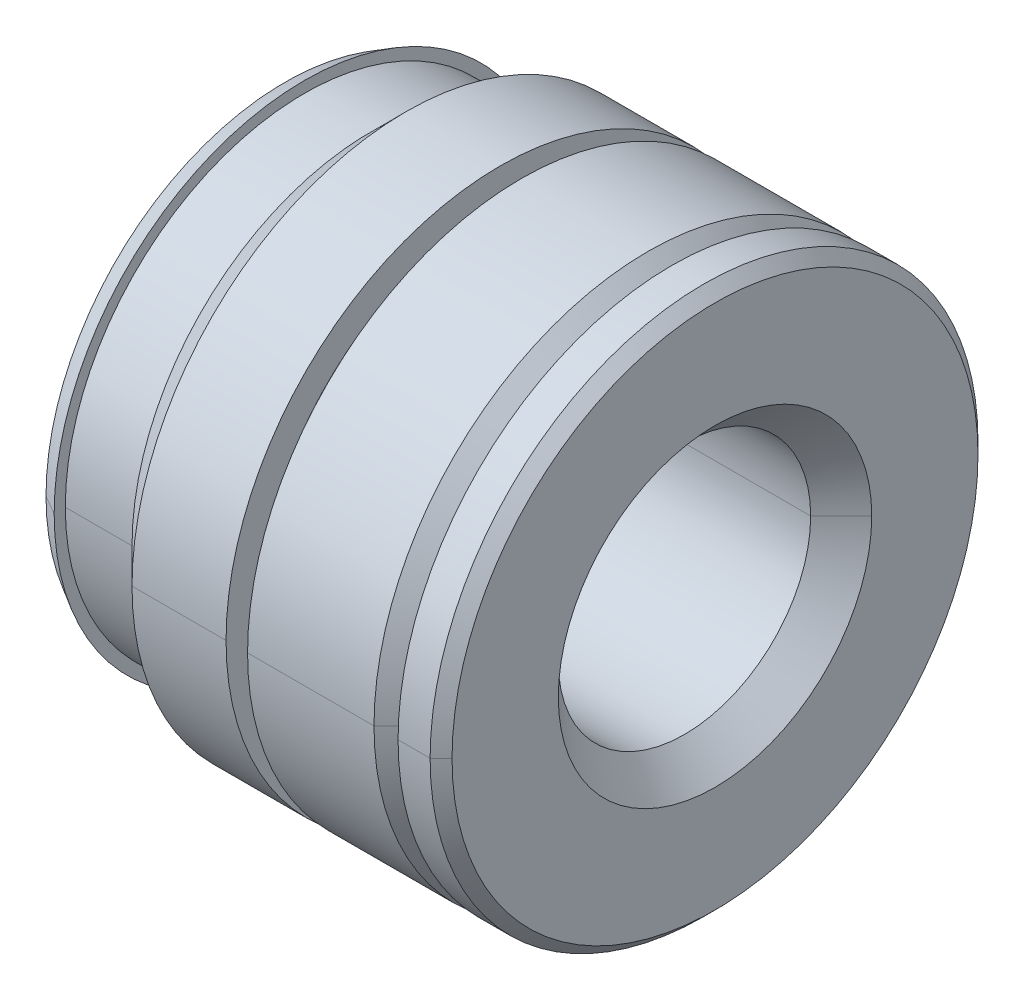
ISO-10303-21;
HEADER;
FILE_DESCRIPTION(('STEP AP214'),'2;1');
FILE_NAME('part.step','',(''),(''),'','','');
FILE_SCHEMA(('AUTOMOTIVE_DESIGN { 1 0 10303 214 1 1 1 1 }'));
ENDSEC;
DATA;
#1=APPLICATION_CONTEXT('core data for automotive mechanical design processes');
#2=APPLICATION_PROTOCOL_DEFINITION('international standard','automotive_design',2000,#1);
#3=PRODUCT_CONTEXT('',#1,'mechanical');
#4=PRODUCT('Part','Part','',(#3));
#5=PRODUCT_RELATED_PRODUCT_CATEGORY('part','',(#4));
#6=PRODUCT_DEFINITION_FORMATION('','',#4);
#7=PRODUCT_DEFINITION_CONTEXT('part definition',#1,'design');
#8=PRODUCT_DEFINITION('design','',#6,#7);
#9=PRODUCT_DEFINITION_SHAPE('','',#8);
#10=(LENGTH_UNIT() NAMED_UNIT(*) SI_UNIT(.MILLI.,.METRE.));
#11=(NAMED_UNIT(*) PLANE_ANGLE_UNIT() SI_UNIT($,.RADIAN.));
#12=(NAMED_UNIT(*) SI_UNIT($,.STERADIAN.) SOLID_ANGLE_UNIT());
#13=UNCERTAINTY_MEASURE_WITH_UNIT(LENGTH_MEASURE(1.E-05),#10,'distance_accuracy_value','');
#14=(GEOMETRIC_REPRESENTATION_CONTEXT(3) GLOBAL_UNCERTAINTY_ASSIGNED_CONTEXT((#13)) GLOBAL_UNIT_ASSIGNED_CONTEXT((#10,
#11,#12)) REPRESENTATION_CONTEXT('',''));
#15=CARTESIAN_POINT('',(0.,0.,0.));
#16=DIRECTION('',(0.,0.,1.));
#17=DIRECTION('',(1.,0.,0.));
#18=AXIS2_PLACEMENT_3D('',#15,#16,#17);
#19=CARTESIAN_POINT('',(-2.60455,0.,0.));
#20=DIRECTION('',(1.,0.,0.));
#21=DIRECTION('',(0.,0.,1.));
#22=AXIS2_PLACEMENT_3D('',#19,#20,#21);
#23=CONICAL_SURFACE('',#22,2.04555,0.785398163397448);
#24=DIRECTION('',(0.707106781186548,0.,0.707106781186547));
#25=VECTOR('',#24,1.);
#26=CARTESIAN_POINT('',(-2.60455,1.83490354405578E-13,2.04555));
#27=LINE('',#26,#25);
#28=CARTESIAN_POINT('',(-2.744,0.,1.9061));
#29=VERTEX_POINT('',#28);
#30=CARTESIAN_POINT('',(-2.4651,0.,2.185));
#31=VERTEX_POINT('',#30);
#32=EDGE_CURVE('E10',#29,#31,#27,.T.);
#33=ORIENTED_EDGE('',*,*,#32,.T.);
#34=CARTESIAN_POINT('',(-2.4651,0.,0.));
#35=DIRECTION('',(1.,0.,0.));
#36=DIRECTION('',(0.,0.,1.));
#37=AXIS2_PLACEMENT_3D('',#34,#35,#36);
#38=CIRCLE('',#37,2.185);
#39=CARTESIAN_POINT('',(-2.4651,-1.95999327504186E-13,-2.185));
#40=VERTEX_POINT('',#39);
#41=EDGE_CURVE('E287',#40,#31,#38,.T.);
#42=ORIENTED_EDGE('',*,*,#41,.F.);
#43=DIRECTION('',(-0.707106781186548,0.,0.707106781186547));
#44=VECTOR('',#43,1.);
#45=CARTESIAN_POINT('',(-2.60455,-1.83490354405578E-13,-2.04555));
#46=LINE('',#45,#44);
#47=CARTESIAN_POINT('',(-2.744,-1.7098138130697E-13,-1.9061));
#48=VERTEX_POINT('',#47);
#49=EDGE_CURVE('E28',#40,#48,#46,.T.);
#50=ORIENTED_EDGE('',*,*,#49,.T.);
#51=CARTESIAN_POINT('',(-2.744,0.,0.));
#52=DIRECTION('',(1.,0.,0.));
#53=DIRECTION('',(0.,0.,1.));
#54=AXIS2_PLACEMENT_3D('',#51,#52,#53);
#55=CIRCLE('',#54,1.9061);
#56=EDGE_CURVE('E309',#48,#29,#55,.T.);
#57=ORIENTED_EDGE('',*,*,#56,.T.);
#58=EDGE_LOOP('',(#33,#42,#50,#57));
#59=FACE_BOUND('',#58,.T.);
#60=ADVANCED_FACE('F17',(#59),#23,.T.);
#61=CARTESIAN_POINT('',(-2.60455,0.,0.));
#62=DIRECTION('',(1.,0.,0.));
#63=DIRECTION('',(0.,0.,1.));
#64=AXIS2_PLACEMENT_3D('',#61,#62,#63);
#65=CONICAL_SURFACE('',#64,2.04555,0.785398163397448);
#66=ORIENTED_EDGE('',*,*,#32,.F.);
#67=CARTESIAN_POINT('',(-2.744,0.,0.));
#68=DIRECTION('',(1.,0.,0.));
#69=DIRECTION('',(0.,0.,1.));
#70=AXIS2_PLACEMENT_3D('',#67,#68,#69);
#71=CIRCLE('',#70,1.9061);
#72=EDGE_CURVE('E298',#29,#48,#71,.T.);
#73=ORIENTED_EDGE('',*,*,#72,.T.);
#74=ORIENTED_EDGE('',*,*,#49,.F.);
#75=CARTESIAN_POINT('',(-2.4651,0.,0.));
#76=DIRECTION('',(1.,0.,0.));
#77=DIRECTION('',(0.,0.,1.));
#78=AXIS2_PLACEMENT_3D('',#75,#76,#77);
#79=CIRCLE('',#78,2.185);
#80=EDGE_CURVE('E43',#31,#40,#79,.T.);
#81=ORIENTED_EDGE('',*,*,#80,.F.);
#82=EDGE_LOOP('',(#66,#73,#74,#81));
#83=FACE_BOUND('',#82,.T.);
#84=ADVANCED_FACE('F426',(#83),#65,.T.);
#85=CARTESIAN_POINT('',(-3.01001034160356,0.,0.));
#86=DIRECTION('',(1.,0.,0.));
#87=DIRECTION('',(0.,0.,1.));
#88=AXIS2_PLACEMENT_3D('',#85,#86,#87);
#89=CYLINDRICAL_SURFACE('',#88,1.9061);
#90=DIRECTION('',(1.,0.,0.));
#91=VECTOR('',#90,1.);
#92=CARTESIAN_POINT('',(-3.01001034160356,1.7098138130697E-13,1.9061));
#93=LINE('',#92,#91);
#94=CARTESIAN_POINT('',(-3.27602068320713,0.,1.9061));
#95=VERTEX_POINT('',#94);
#96=EDGE_CURVE('E294',#95,#29,#93,.T.);
#97=ORIENTED_EDGE('',*,*,#96,.T.);
#98=ORIENTED_EDGE('',*,*,#56,.F.);
#99=DIRECTION('',(-1.,0.,0.));
#100=VECTOR('',#99,1.);
#101=CARTESIAN_POINT('',(-3.01001034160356,-1.7098138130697E-13,-1.9061));
#102=LINE('',#101,#100);
#103=CARTESIAN_POINT('',(-3.27602068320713,-1.7098138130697E-13,-1.9061));
#104=VERTEX_POINT('',#103);
#105=EDGE_CURVE('E271',#48,#104,#102,.T.);
#106=ORIENTED_EDGE('',*,*,#105,.T.);
#107=CARTESIAN_POINT('',(-3.27602068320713,0.,0.));
#108=DIRECTION('',(1.,0.,0.));
#109=DIRECTION('',(0.,0.,1.));
#110=AXIS2_PLACEMENT_3D('',#107,#108,#109);
#111=CIRCLE('',#110,1.9061);
#112=EDGE_CURVE('E269',#104,#95,#111,.T.);
#113=ORIENTED_EDGE('',*,*,#112,.T.);
#114=EDGE_LOOP('',(#97,#98,#106,#113));
#115=FACE_BOUND('',#114,.T.);
#116=ADVANCED_FACE('F433',(#115),#89,.T.);
#117=CARTESIAN_POINT('',(-3.01001034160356,0.,0.));
#118=DIRECTION('',(1.,0.,0.));
#119=DIRECTION('',(0.,0.,1.));
#120=AXIS2_PLACEMENT_3D('',#117,#118,#119);
#121=CYLINDRICAL_SURFACE('',#120,1.9061);
#122=ORIENTED_EDGE('',*,*,#96,.F.);
#123=CARTESIAN_POINT('',(-3.27602068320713,0.,0.));
#124=DIRECTION('',(1.,0.,0.));
#125=DIRECTION('',(0.,0.,1.));
#126=AXIS2_PLACEMENT_3D('',#123,#124,#125);
#127=CIRCLE('',#126,1.9061);
#128=EDGE_CURVE('E272',#95,#104,#127,.T.);
#129=ORIENTED_EDGE('',*,*,#128,.T.);
#130=ORIENTED_EDGE('',*,*,#105,.F.);
#131=ORIENTED_EDGE('',*,*,#72,.F.);
#132=EDGE_LOOP('',(#122,#129,#130,#131));
#133=FACE_BOUND('',#132,.T.);
#134=ADVANCED_FACE('F467',(#133),#121,.T.);
#135=CARTESIAN_POINT('',(-2.09005,0.,0.));
#136=DIRECTION('',(1.,0.,0.));
#137=DIRECTION('',(0.,0.,1.));
#138=AXIS2_PLACEMENT_3D('',#135,#136,#137);
#139=CYLINDRICAL_SURFACE('',#138,2.185);
#140=DIRECTION('',(1.,0.,0.));
#141=VECTOR('',#140,1.);
#142=CARTESIAN_POINT('',(-2.09005,1.95999327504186E-13,2.185));
#143=LINE('',#142,#141);
#144=CARTESIAN_POINT('',(-1.715,0.,2.185));
#145=VERTEX_POINT('',#144);
#146=EDGE_CURVE('E21',#31,#145,#143,.T.);
#147=ORIENTED_EDGE('',*,*,#146,.T.);
#148=CARTESIAN_POINT('',(-1.715,0.,0.));
#149=DIRECTION('',(1.,0.,0.));
#150=DIRECTION('',(0.,0.,1.));
#151=AXIS2_PLACEMENT_3D('',#148,#149,#150);
#152=CIRCLE('',#151,2.185);
#153=CARTESIAN_POINT('',(-1.715,-1.95999327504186E-13,-2.185));
#154=VERTEX_POINT('',#153);
#155=EDGE_CURVE('E261',#154,#145,#152,.T.);
#156=ORIENTED_EDGE('',*,*,#155,.F.);
#157=DIRECTION('',(-1.,0.,0.));
#158=VECTOR('',#157,1.);
#159=CARTESIAN_POINT('',(-2.09005,-1.95999327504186E-13,-2.185));
#160=LINE('',#159,#158);
#161=EDGE_CURVE('E283',#154,#40,#160,.T.);
#162=ORIENTED_EDGE('',*,*,#161,.T.);
#163=ORIENTED_EDGE('',*,*,#41,.T.);
#164=EDGE_LOOP('',(#147,#156,#162,#163));
#165=FACE_BOUND('',#164,.T.);
#166=ADVANCED_FACE('F442',(#165),#139,.T.);
#167=CARTESIAN_POINT('',(-2.09005,0.,0.));
#168=DIRECTION('',(1.,0.,0.));
#169=DIRECTION('',(0.,0.,1.));
#170=AXIS2_PLACEMENT_3D('',#167,#168,#169);
#171=CYLINDRICAL_SURFACE('',#170,2.185);
#172=ORIENTED_EDGE('',*,*,#146,.F.);
#173=ORIENTED_EDGE('',*,*,#80,.T.);
#174=ORIENTED_EDGE('',*,*,#161,.F.);
#175=CARTESIAN_POINT('',(-1.715,0.,0.));
#176=DIRECTION('',(1.,0.,0.));
#177=DIRECTION('',(0.,0.,1.));
#178=AXIS2_PLACEMENT_3D('',#175,#176,#177);
#179=CIRCLE('',#178,2.185);
#180=EDGE_CURVE('E228',#145,#154,#179,.T.);
#181=ORIENTED_EDGE('',*,*,#180,.F.);
#182=EDGE_LOOP('',(#172,#173,#174,#181));
#183=FACE_BOUND('',#182,.T.);
#184=ADVANCED_FACE('F439',(#183),#171,.T.);
#185=CARTESIAN_POINT('',(-3.27602068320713,0.,1.95055));
#186=DIRECTION('',(1.,0.,0.));
#187=DIRECTION('',(0.,0.,1.));
#188=AXIS2_PLACEMENT_3D('',#185,#186,#187);
#189=PLANE('',#188);
#190=ORIENTED_EDGE('',*,*,#128,.F.);
#191=ORIENTED_EDGE('',*,*,#112,.F.);
#192=EDGE_LOOP('',(#190,#191));
#193=FACE_BOUND('',#192,.T.);
#194=CARTESIAN_POINT('',(-3.27602068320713,0.,0.));
#195=DIRECTION('',(1.,0.,0.));
#196=DIRECTION('',(0.,0.,1.));
#197=AXIS2_PLACEMENT_3D('',#194,#195,#196);
#198=CIRCLE('',#197,1.995);
#199=CARTESIAN_POINT('',(-3.27602068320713,0.,1.995));
#200=VERTEX_POINT('',#199);
#201=CARTESIAN_POINT('',(-3.27602068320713,-1.78955907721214E-13,-1.995));
#202=VERTEX_POINT('',#201);
#203=EDGE_CURVE('E227',#200,#202,#198,.T.);
#204=ORIENTED_EDGE('',*,*,#203,.T.);
#205=CARTESIAN_POINT('',(-3.27602068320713,0.,0.));
#206=DIRECTION('',(1.,0.,0.));
#207=DIRECTION('',(0.,0.,1.));
#208=AXIS2_PLACEMENT_3D('',#205,#206,#207);
#209=CIRCLE('',#208,1.995);
#210=EDGE_CURVE('E224',#202,#200,#209,.T.);
#211=ORIENTED_EDGE('',*,*,#210,.T.);
#212=EDGE_LOOP('',(#204,#211));
#213=FACE_BOUND('',#212,.T.);
#214=ADVANCED_FACE('F441',(#193,#213),#189,.T.);
#215=CARTESIAN_POINT('',(-1.715,0.,2.065));
#216=DIRECTION('',(1.,0.,0.));
#217=DIRECTION('',(0.,0.,1.));
#218=AXIS2_PLACEMENT_3D('',#215,#216,#217);
#219=PLANE('',#218);
#220=CARTESIAN_POINT('',(-1.715,0.,0.));
#221=DIRECTION('',(1.,0.,0.));
#222=DIRECTION('',(0.,0.,1.));
#223=AXIS2_PLACEMENT_3D('',#220,#221,#222);
#224=CIRCLE('',#223,1.945);
#225=CARTESIAN_POINT('',(-1.715,0.,1.945));
#226=VERTEX_POINT('',#225);
#227=CARTESIAN_POINT('',(-1.715,-1.7447079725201E-13,-1.945));
#228=VERTEX_POINT('',#227);
#229=EDGE_CURVE('E235',#226,#228,#224,.T.);
#230=ORIENTED_EDGE('',*,*,#229,.F.);
#231=CARTESIAN_POINT('',(-1.715,0.,0.));
#232=DIRECTION('',(1.,0.,0.));
#233=DIRECTION('',(0.,0.,1.));
#234=AXIS2_PLACEMENT_3D('',#231,#232,#233);
#235=CIRCLE('',#234,1.945);
#236=EDGE_CURVE('E237',#228,#226,#235,.T.);
#237=ORIENTED_EDGE('',*,*,#236,.F.);
#238=EDGE_LOOP('',(#230,#237));
#239=FACE_BOUND('',#238,.T.);
#240=ORIENTED_EDGE('',*,*,#180,.T.);
#241=ORIENTED_EDGE('',*,*,#155,.T.);
#242=EDGE_LOOP('',(#240,#241));
#243=FACE_BOUND('',#242,.T.);
#244=ADVANCED_FACE('F471',(#239,#243),#219,.T.);
#245=CARTESIAN_POINT('',(-3.35301034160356,0.,0.));
#246=DIRECTION('',(1.,0.,0.));
#247=DIRECTION('',(0.,0.,1.));
#248=AXIS2_PLACEMENT_3D('',#245,#246,#247);
#249=CONICAL_SURFACE('',#248,1.95055,0.523598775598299);
#250=DIRECTION('',(0.866025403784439,0.,0.5));
#251=VECTOR('',#250,1.);
#252=CARTESIAN_POINT('',(-3.35301034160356,1.74968644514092E-13,1.95055));
#253=LINE('',#252,#251);
#254=CARTESIAN_POINT('',(-3.43,0.,1.9061));
#255=VERTEX_POINT('',#254);
#256=EDGE_CURVE('E257',#255,#200,#253,.T.);
#257=ORIENTED_EDGE('',*,*,#256,.T.);
#258=ORIENTED_EDGE('',*,*,#210,.F.);
#259=DIRECTION('',(-0.866025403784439,0.,0.5));
#260=VECTOR('',#259,1.);
#261=CARTESIAN_POINT('',(-3.35301034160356,-1.74968644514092E-13,-1.95055));
#262=LINE('',#261,#260);
#263=CARTESIAN_POINT('',(-3.43,-1.7098138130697E-13,-1.9061));
#264=VERTEX_POINT('',#263);
#265=EDGE_CURVE('E262',#202,#264,#262,.T.);
#266=ORIENTED_EDGE('',*,*,#265,.T.);
#267=CARTESIAN_POINT('',(-3.43,0.,0.));
#268=DIRECTION('',(1.,0.,0.));
#269=DIRECTION('',(0.,0.,1.));
#270=AXIS2_PLACEMENT_3D('',#267,#268,#269);
#271=CIRCLE('',#270,1.9061);
#272=EDGE_CURVE('E321',#264,#255,#271,.T.);
#273=ORIENTED_EDGE('',*,*,#272,.T.);
#274=EDGE_LOOP('',(#257,#258,#266,#273));
#275=FACE_BOUND('',#274,.T.);
#276=ADVANCED_FACE('F474',(#275),#249,.T.);
#277=CARTESIAN_POINT('',(-3.35301034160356,0.,0.));
#278=DIRECTION('',(1.,0.,0.));
#279=DIRECTION('',(0.,0.,1.));
#280=AXIS2_PLACEMENT_3D('',#277,#278,#279);
#281=CONICAL_SURFACE('',#280,1.95055,0.523598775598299);
#282=ORIENTED_EDGE('',*,*,#256,.F.);
#283=CARTESIAN_POINT('',(-3.43,0.,0.));
#284=DIRECTION('',(1.,0.,0.));
#285=DIRECTION('',(0.,0.,1.));
#286=AXIS2_PLACEMENT_3D('',#283,#284,#285);
#287=CIRCLE('',#286,1.9061);
#288=EDGE_CURVE('E278',#255,#264,#287,.T.);
#289=ORIENTED_EDGE('',*,*,#288,.T.);
#290=ORIENTED_EDGE('',*,*,#265,.F.);
#291=ORIENTED_EDGE('',*,*,#203,.F.);
#292=EDGE_LOOP('',(#282,#289,#290,#291));
#293=FACE_BOUND('',#292,.T.);
#294=ADVANCED_FACE('F460',(#293),#281,.T.);
#295=CARTESIAN_POINT('',(-1.62925,0.,0.));
#296=DIRECTION('',(1.,0.,0.));
#297=DIRECTION('',(0.,0.,1.));
#298=AXIS2_PLACEMENT_3D('',#295,#296,#297);
#299=CYLINDRICAL_SURFACE('',#298,1.945);
#300=DIRECTION('',(1.,0.,0.));
#301=VECTOR('',#300,1.);
#302=CARTESIAN_POINT('',(-1.62925,1.7447079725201E-13,1.945));
#303=LINE('',#302,#301);
#304=CARTESIAN_POINT('',(-1.5435,0.,1.945));
#305=VERTEX_POINT('',#304);
#306=EDGE_CURVE('E274',#226,#305,#303,.T.);
#307=ORIENTED_EDGE('',*,*,#306,.T.);
#308=CARTESIAN_POINT('',(-1.5435,0.,0.));
#309=DIRECTION('',(1.,0.,0.));
#310=DIRECTION('',(0.,0.,1.));
#311=AXIS2_PLACEMENT_3D('',#308,#309,#310);
#312=CIRCLE('',#311,1.945);
#313=CARTESIAN_POINT('',(-1.5435,-1.7447079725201E-13,-1.945));
#314=VERTEX_POINT('',#313);
#315=EDGE_CURVE('E251',#314,#305,#312,.T.);
#316=ORIENTED_EDGE('',*,*,#315,.F.);
#317=DIRECTION('',(-1.,0.,0.));
#318=VECTOR('',#317,1.);
#319=CARTESIAN_POINT('',(-1.62925,-1.7447079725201E-13,-1.945));
#320=LINE('',#319,#318);
#321=EDGE_CURVE('E279',#314,#228,#320,.T.);
#322=ORIENTED_EDGE('',*,*,#321,.T.);
#323=ORIENTED_EDGE('',*,*,#236,.T.);
#324=EDGE_LOOP('',(#307,#316,#322,#323));
#325=FACE_BOUND('',#324,.T.);
#326=ADVANCED_FACE('F456',(#325),#299,.T.);
#327=CARTESIAN_POINT('',(-1.62925,0.,0.));
#328=DIRECTION('',(1.,0.,0.));
#329=DIRECTION('',(0.,0.,1.));
#330=AXIS2_PLACEMENT_3D('',#327,#328,#329);
#331=CYLINDRICAL_SURFACE('',#330,1.945);
#332=ORIENTED_EDGE('',*,*,#306,.F.);
#333=ORIENTED_EDGE('',*,*,#229,.T.);
#334=ORIENTED_EDGE('',*,*,#321,.F.);
#335=CARTESIAN_POINT('',(-1.5435,0.,0.));
#336=DIRECTION('',(1.,0.,0.));
#337=DIRECTION('',(0.,0.,1.));
#338=AXIS2_PLACEMENT_3D('',#335,#336,#337);
#339=CIRCLE('',#338,1.945);
#340=EDGE_CURVE('E243',#305,#314,#339,.T.);
#341=ORIENTED_EDGE('',*,*,#340,.F.);
#342=EDGE_LOOP('',(#332,#333,#334,#341));
#343=FACE_BOUND('',#342,.T.);
#344=ADVANCED_FACE('F459',(#343),#331,.T.);
#345=CARTESIAN_POINT('',(-3.43,0.,0.95305));
#346=DIRECTION('',(-1.,0.,0.));
#347=DIRECTION('',(0.,0.,1.));
#348=AXIS2_PLACEMENT_3D('',#345,#346,#347);
#349=PLANE('',#348);
#350=CARTESIAN_POINT('',(-3.43,0.,0.));
#351=DIRECTION('',(1.,0.,0.));
#352=DIRECTION('',(0.,0.,1.));
#353=AXIS2_PLACEMENT_3D('',#350,#351,#352);
#354=CIRCLE('',#353,1.25);
#355=CARTESIAN_POINT('',(-3.43,0.,1.25));
#356=VERTEX_POINT('',#355);
#357=CARTESIAN_POINT('',(-3.43,0.,-1.25));
#358=VERTEX_POINT('',#357);
#359=EDGE_CURVE('E238',#356,#358,#354,.T.);
#360=ORIENTED_EDGE('',*,*,#359,.T.);
#361=CARTESIAN_POINT('',(-3.43,0.,0.));
#362=DIRECTION('',(1.,0.,0.));
#363=DIRECTION('',(0.,0.,1.));
#364=AXIS2_PLACEMENT_3D('',#361,#362,#363);
#365=CIRCLE('',#364,1.25);
#366=EDGE_CURVE('E240',#358,#356,#365,.T.);
#367=ORIENTED_EDGE('',*,*,#366,.T.);
#368=EDGE_LOOP('',(#360,#367));
#369=FACE_BOUND('',#368,.T.);
#370=ORIENTED_EDGE('',*,*,#288,.F.);
#371=ORIENTED_EDGE('',*,*,#272,.F.);
#372=EDGE_LOOP('',(#370,#371));
#373=FACE_BOUND('',#372,.T.);
#374=ADVANCED_FACE('F454',(#369,#373),#349,.T.);
#375=CARTESIAN_POINT('',(-1.5435,0.,2.065));
#376=DIRECTION('',(-1.,0.,0.));
#377=DIRECTION('',(0.,0.,1.));
#378=AXIS2_PLACEMENT_3D('',#375,#376,#377);
#379=PLANE('',#378);
#380=CARTESIAN_POINT('',(-1.5435,0.,0.));
#381=DIRECTION('',(1.,0.,0.));
#382=DIRECTION('',(0.,0.,1.));
#383=AXIS2_PLACEMENT_3D('',#380,#381,#382);
#384=CIRCLE('',#383,2.185);
#385=CARTESIAN_POINT('',(-1.5435,0.,2.185));
#386=VERTEX_POINT('',#385);
#387=CARTESIAN_POINT('',(-1.5435,-1.95999327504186E-13,-2.185));
#388=VERTEX_POINT('',#387);
#389=EDGE_CURVE('E315',#386,#388,#384,.T.);
#390=ORIENTED_EDGE('',*,*,#389,.F.);
#391=CARTESIAN_POINT('',(-1.5435,0.,0.));
#392=DIRECTION('',(1.,0.,0.));
#393=DIRECTION('',(0.,0.,1.));
#394=AXIS2_PLACEMENT_3D('',#391,#392,#393);
#395=CIRCLE('',#394,2.185);
#396=EDGE_CURVE('E310',#388,#386,#395,.T.);
#397=ORIENTED_EDGE('',*,*,#396,.F.);
#398=EDGE_LOOP('',(#390,#397));
#399=FACE_BOUND('',#398,.T.);
#400=ORIENTED_EDGE('',*,*,#340,.T.);
#401=ORIENTED_EDGE('',*,*,#315,.T.);
#402=EDGE_LOOP('',(#400,#401));
#403=FACE_BOUND('',#402,.T.);
#404=ADVANCED_FACE('F450',(#399,#403),#379,.T.);
#405=CARTESIAN_POINT('',(-3.30825,0.,0.));
#406=DIRECTION('',(-1.,0.,0.));
#407=DIRECTION('',(0.,0.,-1.));
#408=AXIS2_PLACEMENT_3D('',#405,#406,#407);
#409=CONICAL_SURFACE('',#408,1.12825,0.785398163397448);
#410=DIRECTION('',(0.707106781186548,0.,0.707106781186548));
#411=VECTOR('',#410,1.);
#412=CARTESIAN_POINT('',(-3.30825,0.,-1.12825));
#413=LINE('',#412,#411);
#414=CARTESIAN_POINT('',(-3.1865,0.,-1.0065));
#415=VERTEX_POINT('',#414);
#416=EDGE_CURVE('E252',#358,#415,#413,.T.);
#417=ORIENTED_EDGE('',*,*,#416,.F.);
#418=ORIENTED_EDGE('',*,*,#359,.F.);
#419=DIRECTION('',(-0.707106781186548,0.,0.707106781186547));
#420=VECTOR('',#419,1.);
#421=CARTESIAN_POINT('',(-3.30825,0.,1.12825));
#422=LINE('',#421,#420);
#423=CARTESIAN_POINT('',(-3.1865,0.,1.0065));
#424=VERTEX_POINT('',#423);
#425=EDGE_CURVE('E288',#424,#356,#422,.T.);
#426=ORIENTED_EDGE('',*,*,#425,.F.);
#427=CARTESIAN_POINT('',(-3.1865,0.,0.));
#428=DIRECTION('',(1.,0.,0.));
#429=DIRECTION('',(0.,0.,-1.));
#430=AXIS2_PLACEMENT_3D('',#427,#428,#429);
#431=CIRCLE('',#430,1.0065);
#432=EDGE_CURVE('E247',#424,#415,#431,.T.);
#433=ORIENTED_EDGE('',*,*,#432,.T.);
#434=EDGE_LOOP('',(#417,#418,#426,#433));
#435=FACE_BOUND('',#434,.T.);
#436=ADVANCED_FACE('F453',(#435),#409,.F.);
#437=CARTESIAN_POINT('',(-3.30825,0.,0.));
#438=DIRECTION('',(-1.,0.,0.));
#439=DIRECTION('',(0.,0.,-1.));
#440=AXIS2_PLACEMENT_3D('',#437,#438,#439);
#441=CONICAL_SURFACE('',#440,1.12825,0.785398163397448);
#442=ORIENTED_EDGE('',*,*,#416,.T.);
#443=CARTESIAN_POINT('',(-3.1865,0.,0.));
#444=DIRECTION('',(1.,0.,0.));
#445=DIRECTION('',(0.,0.,-1.));
#446=AXIS2_PLACEMENT_3D('',#443,#444,#445);
#447=CIRCLE('',#446,1.0065);
#448=EDGE_CURVE('E291',#415,#424,#447,.T.);
#449=ORIENTED_EDGE('',*,*,#448,.T.);
#450=ORIENTED_EDGE('',*,*,#425,.T.);
#451=ORIENTED_EDGE('',*,*,#366,.F.);
#452=EDGE_LOOP('',(#442,#449,#450,#451));
#453=FACE_BOUND('',#452,.T.);
#454=ADVANCED_FACE('F488',(#453),#441,.F.);
#455=CARTESIAN_POINT('',(-1.03925,0.,0.));
#456=DIRECTION('',(1.,0.,0.));
#457=DIRECTION('',(0.,0.,1.));
#458=AXIS2_PLACEMENT_3D('',#455,#456,#457);
#459=CYLINDRICAL_SURFACE('',#458,2.185);
#460=DIRECTION('',(1.,0.,0.));
#461=VECTOR('',#460,1.);
#462=CARTESIAN_POINT('',(-1.03925,1.95999327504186E-13,2.185));
#463=LINE('',#462,#461);
#464=CARTESIAN_POINT('',(-0.535,0.,2.185));
#465=VERTEX_POINT('',#464);
#466=EDGE_CURVE('E292',#386,#465,#463,.T.);
#467=ORIENTED_EDGE('',*,*,#466,.T.);
#468=CARTESIAN_POINT('',(-0.535,0.,0.));
#469=DIRECTION('',(1.,0.,0.));
#470=DIRECTION('',(0.,0.,1.));
#471=AXIS2_PLACEMENT_3D('',#468,#469,#470);
#472=CIRCLE('',#471,2.185);
#473=CARTESIAN_POINT('',(-0.535,-1.95999327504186E-13,-2.185));
#474=VERTEX_POINT('',#473);
#475=EDGE_CURVE('E299',#474,#465,#472,.T.);
#476=ORIENTED_EDGE('',*,*,#475,.F.);
#477=DIRECTION('',(-1.,0.,0.));
#478=VECTOR('',#477,1.);
#479=CARTESIAN_POINT('',(-1.03925,-1.95999327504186E-13,-2.185));
#480=LINE('',#479,#478);
#481=EDGE_CURVE('E314',#474,#388,#480,.T.);
#482=ORIENTED_EDGE('',*,*,#481,.T.);
#483=ORIENTED_EDGE('',*,*,#396,.T.);
#484=EDGE_LOOP('',(#467,#476,#482,#483));
#485=FACE_BOUND('',#484,.T.);
#486=ADVANCED_FACE('F437',(#485),#459,.T.);
#487=CARTESIAN_POINT('',(-1.03925,0.,0.));
#488=DIRECTION('',(1.,0.,0.));
#489=DIRECTION('',(0.,0.,1.));
#490=AXIS2_PLACEMENT_3D('',#487,#488,#489);
#491=CYLINDRICAL_SURFACE('',#490,2.185);
#492=ORIENTED_EDGE('',*,*,#466,.F.);
#493=ORIENTED_EDGE('',*,*,#389,.T.);
#494=ORIENTED_EDGE('',*,*,#481,.F.);
#495=CARTESIAN_POINT('',(-0.535,0.,0.));
#496=DIRECTION('',(1.,0.,0.));
#497=DIRECTION('',(0.,0.,1.));
#498=AXIS2_PLACEMENT_3D('',#495,#496,#497);
#499=CIRCLE('',#498,2.185);
#500=EDGE_CURVE('E202',#465,#474,#499,.T.);
#501=ORIENTED_EDGE('',*,*,#500,.F.);
#502=EDGE_LOOP('',(#492,#493,#494,#501));
#503=FACE_BOUND('',#502,.T.);
#504=ADVANCED_FACE('F445',(#503),#491,.T.);
#505=CARTESIAN_POINT('',(-1.715,0.,0.));
#506=DIRECTION('',(1.,0.,0.));
#507=DIRECTION('',(0.,0.,-1.));
#508=AXIS2_PLACEMENT_3D('',#505,#506,#507);
#509=CYLINDRICAL_SURFACE('',#508,1.0065);
#510=DIRECTION('',(1.,0.,0.));
#511=VECTOR('',#510,1.);
#512=CARTESIAN_POINT('',(-1.715,0.,-1.0065));
#513=LINE('',#512,#511);
#514=CARTESIAN_POINT('',(-0.2435,0.,-1.0065));
#515=VERTEX_POINT('',#514);
#516=EDGE_CURVE('E345',#415,#515,#513,.T.);
#517=ORIENTED_EDGE('',*,*,#516,.F.);
#518=ORIENTED_EDGE('',*,*,#432,.F.);
#519=DIRECTION('',(-1.,0.,0.));
#520=VECTOR('',#519,1.);
#521=CARTESIAN_POINT('',(-1.715,0.,1.0065));
#522=LINE('',#521,#520);
#523=CARTESIAN_POINT('',(-0.2435,0.,1.0065));
#524=VERTEX_POINT('',#523);
#525=EDGE_CURVE('E316',#524,#424,#522,.T.);
#526=ORIENTED_EDGE('',*,*,#525,.F.);
#527=CARTESIAN_POINT('',(-0.2435,0.,0.));
#528=DIRECTION('',(1.,0.,0.));
#529=DIRECTION('',(0.,0.,-1.));
#530=AXIS2_PLACEMENT_3D('',#527,#528,#529);
#531=CIRCLE('',#530,1.0065);
#532=EDGE_CURVE('E351',#524,#515,#531,.T.);
#533=ORIENTED_EDGE('',*,*,#532,.T.);
#534=EDGE_LOOP('',(#517,#518,#526,#533));
#535=FACE_BOUND('',#534,.T.);
#536=ADVANCED_FACE('F448',(#535),#509,.F.);
#537=CARTESIAN_POINT('',(-1.715,0.,0.));
#538=DIRECTION('',(1.,0.,0.));
#539=DIRECTION('',(0.,0.,-1.));
#540=AXIS2_PLACEMENT_3D('',#537,#538,#539);
#541=CYLINDRICAL_SURFACE('',#540,1.0065);
#542=ORIENTED_EDGE('',*,*,#516,.T.);
#543=CARTESIAN_POINT('',(-0.2435,0.,0.));
#544=DIRECTION('',(1.,0.,0.));
#545=DIRECTION('',(0.,0.,-1.));
#546=AXIS2_PLACEMENT_3D('',#543,#544,#545);
#547=CIRCLE('',#546,1.0065);
#548=EDGE_CURVE('E199',#515,#524,#547,.T.);
#549=ORIENTED_EDGE('',*,*,#548,.T.);
#550=ORIENTED_EDGE('',*,*,#525,.T.);
#551=ORIENTED_EDGE('',*,*,#448,.F.);
#552=EDGE_LOOP('',(#542,#549,#550,#551));
#553=FACE_BOUND('',#552,.T.);
#554=ADVANCED_FACE('F462',(#553),#541,.F.);
#555=CARTESIAN_POINT('',(-0.439,0.,0.));
#556=DIRECTION('',(-1.,0.,0.));
#557=DIRECTION('',(0.,0.,1.));
#558=AXIS2_PLACEMENT_3D('',#555,#556,#557);
#559=CONICAL_SURFACE('',#558,2.089,0.785398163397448);
#560=DIRECTION('',(0.707106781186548,0.,-0.707106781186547));
#561=VECTOR('',#560,1.);
#562=CARTESIAN_POINT('',(-0.439,1.87387915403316E-13,2.089));
#563=LINE('',#562,#561);
#564=CARTESIAN_POINT('',(-0.343,0.,1.993));
#565=VERTEX_POINT('',#564);
#566=EDGE_CURVE('E320',#465,#565,#563,.T.);
#567=ORIENTED_EDGE('',*,*,#566,.T.);
#568=CARTESIAN_POINT('',(-0.343,0.,0.));
#569=DIRECTION('',(1.,0.,0.));
#570=DIRECTION('',(0.,0.,1.));
#571=AXIS2_PLACEMENT_3D('',#568,#569,#570);
#572=CIRCLE('',#571,1.993);
#573=CARTESIAN_POINT('',(-0.343,-1.78776503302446E-13,-1.993));
#574=VERTEX_POINT('',#573);
#575=EDGE_CURVE('E219',#574,#565,#572,.T.);
#576=ORIENTED_EDGE('',*,*,#575,.F.);
#577=DIRECTION('',(-0.707106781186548,0.,-0.707106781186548));
#578=VECTOR('',#577,1.);
#579=CARTESIAN_POINT('',(-0.439,-1.87387915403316E-13,-2.089));
#580=LINE('',#579,#578);
#581=EDGE_CURVE('E303',#574,#474,#580,.T.);
#582=ORIENTED_EDGE('',*,*,#581,.T.);
#583=ORIENTED_EDGE('',*,*,#475,.T.);
#584=EDGE_LOOP('',(#567,#576,#582,#583));
#585=FACE_BOUND('',#584,.T.);
#586=ADVANCED_FACE('F465',(#585),#559,.T.);
#587=CARTESIAN_POINT('',(-0.439,0.,0.));
#588=DIRECTION('',(-1.,0.,0.));
#589=DIRECTION('',(0.,0.,1.));
#590=AXIS2_PLACEMENT_3D('',#587,#588,#589);
#591=CONICAL_SURFACE('',#590,2.089,0.785398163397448);
#592=ORIENTED_EDGE('',*,*,#566,.F.);
#593=ORIENTED_EDGE('',*,*,#500,.T.);
#594=ORIENTED_EDGE('',*,*,#581,.F.);
#595=CARTESIAN_POINT('',(-0.343,0.,0.));
#596=DIRECTION('',(1.,0.,0.));
#597=DIRECTION('',(0.,0.,1.));
#598=AXIS2_PLACEMENT_3D('',#595,#596,#597);
#599=CIRCLE('',#598,1.993);
#600=EDGE_CURVE('E222',#565,#574,#599,.T.);
#601=ORIENTED_EDGE('',*,*,#600,.F.);
#602=EDGE_LOOP('',(#592,#593,#594,#601));
#603=FACE_BOUND('',#602,.T.);
#604=ADVANCED_FACE('F481',(#603),#591,.T.);
#605=CARTESIAN_POINT('',(-0.12175,0.,0.));
#606=DIRECTION('',(1.,0.,0.));
#607=DIRECTION('',(0.,0.,-1.));
#608=AXIS2_PLACEMENT_3D('',#605,#606,#607);
#609=CONICAL_SURFACE('',#608,1.12825,0.785398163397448);
#610=DIRECTION('',(0.707106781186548,0.,-0.707106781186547));
#611=VECTOR('',#610,1.);
#612=CARTESIAN_POINT('',(-0.12175,0.,-1.12825));
#613=LINE('',#612,#611);
#614=CARTESIAN_POINT('',(0.,0.,-1.25));
#615=VERTEX_POINT('',#614);
#616=EDGE_CURVE('E186',#515,#615,#613,.T.);
#617=ORIENTED_EDGE('',*,*,#616,.F.);
#618=ORIENTED_EDGE('',*,*,#532,.F.);
#619=DIRECTION('',(-0.707106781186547,0.,-0.707106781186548));
#620=VECTOR('',#619,1.);
#621=CARTESIAN_POINT('',(-0.12175,0.,1.12825));
#622=LINE('',#621,#620);
#623=CARTESIAN_POINT('',(0.,0.,1.25));
#624=VERTEX_POINT('',#623);
#625=EDGE_CURVE('E188',#624,#524,#622,.T.);
#626=ORIENTED_EDGE('',*,*,#625,.F.);
#627=CARTESIAN_POINT('',(0.,0.,0.));
#628=DIRECTION('',(-1.,0.,0.));
#629=DIRECTION('',(0.,0.,1.));
#630=AXIS2_PLACEMENT_3D('',#627,#628,#629);
#631=CIRCLE('',#630,1.25);
#632=EDGE_CURVE('E182',#615,#624,#631,.T.);
#633=ORIENTED_EDGE('',*,*,#632,.F.);
#634=EDGE_LOOP('',(#617,#618,#626,#633));
#635=FACE_BOUND('',#634,.T.);
#636=ADVANCED_FACE('F184',(#635),#609,.F.);
#637=CARTESIAN_POINT('',(-0.12175,0.,0.));
#638=DIRECTION('',(1.,0.,0.));
#639=DIRECTION('',(0.,0.,-1.));
#640=AXIS2_PLACEMENT_3D('',#637,#638,#639);
#641=CONICAL_SURFACE('',#640,1.12825,0.785398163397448);
#642=ORIENTED_EDGE('',*,*,#616,.T.);
#643=CARTESIAN_POINT('',(0.,0.,0.));
#644=DIRECTION('',(-1.,0.,0.));
#645=DIRECTION('',(0.,0.,1.));
#646=AXIS2_PLACEMENT_3D('',#643,#644,#645);
#647=CIRCLE('',#646,1.25);
#648=EDGE_CURVE('E193',#624,#615,#647,.T.);
#649=ORIENTED_EDGE('',*,*,#648,.F.);
#650=ORIENTED_EDGE('',*,*,#625,.T.);
#651=ORIENTED_EDGE('',*,*,#548,.F.);
#652=EDGE_LOOP('',(#642,#649,#650,#651));
#653=FACE_BOUND('',#652,.T.);
#654=ADVANCED_FACE('F197',(#653),#641,.F.);
#655=CARTESIAN_POINT('',(-0.343,0.,2.089));
#656=DIRECTION('',(-1.,0.,0.));
#657=DIRECTION('',(0.,0.,1.));
#658=AXIS2_PLACEMENT_3D('',#655,#656,#657);
#659=PLANE('',#658);
#660=CARTESIAN_POINT('',(-0.343,0.,0.));
#661=DIRECTION('',(1.,0.,0.));
#662=DIRECTION('',(0.,0.,1.));
#663=AXIS2_PLACEMENT_3D('',#660,#661,#662);
#664=CIRCLE('',#663,2.185);
#665=CARTESIAN_POINT('',(-0.343,0.,2.185));
#666=VERTEX_POINT('',#665);
#667=CARTESIAN_POINT('',(-0.343,-1.95999327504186E-13,-2.185));
#668=VERTEX_POINT('',#667);
#669=EDGE_CURVE('E267',#666,#668,#664,.T.);
#670=ORIENTED_EDGE('',*,*,#669,.F.);
#671=CARTESIAN_POINT('',(-0.343,0.,0.));
#672=DIRECTION('',(1.,0.,0.));
#673=DIRECTION('',(0.,0.,1.));
#674=AXIS2_PLACEMENT_3D('',#671,#672,#673);
#675=CIRCLE('',#674,2.185);
#676=EDGE_CURVE('E207',#668,#666,#675,.T.);
#677=ORIENTED_EDGE('',*,*,#676,.F.);
#678=EDGE_LOOP('',(#670,#677));
#679=FACE_BOUND('',#678,.T.);
#680=ORIENTED_EDGE('',*,*,#600,.T.);
#681=ORIENTED_EDGE('',*,*,#575,.T.);
#682=EDGE_LOOP('',(#680,#681));
#683=FACE_BOUND('',#682,.T.);
#684=ADVANCED_FACE('F403',(#679,#683),#659,.T.);
#685=CARTESIAN_POINT('',(-0.2152,0.,0.));
#686=DIRECTION('',(1.,0.,0.));
#687=DIRECTION('',(0.,0.,1.));
#688=AXIS2_PLACEMENT_3D('',#685,#686,#687);
#689=CYLINDRICAL_SURFACE('',#688,2.185);
#690=DIRECTION('',(1.,0.,0.));
#691=VECTOR('',#690,1.);
#692=CARTESIAN_POINT('',(-0.2152,1.95999327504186E-13,2.185));
#693=LINE('',#692,#691);
#694=CARTESIAN_POINT('',(-0.0874,0.,2.185));
#695=VERTEX_POINT('',#694);
#696=EDGE_CURVE('E223',#666,#695,#693,.T.);
#697=ORIENTED_EDGE('',*,*,#696,.T.);
#698=CARTESIAN_POINT('',(-0.0874,0.,0.));
#699=DIRECTION('',(1.,0.,0.));
#700=DIRECTION('',(0.,0.,1.));
#701=AXIS2_PLACEMENT_3D('',#698,#699,#700);
#702=CIRCLE('',#701,2.185);
#703=CARTESIAN_POINT('',(-0.0873999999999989,-1.95999327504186E-13,-2.185));
#704=VERTEX_POINT('',#703);
#705=EDGE_CURVE('E255',#704,#695,#702,.T.);
#706=ORIENTED_EDGE('',*,*,#705,.F.);
#707=DIRECTION('',(-1.,0.,0.));
#708=VECTOR('',#707,1.);
#709=CARTESIAN_POINT('',(-0.2152,-1.95999327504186E-13,-2.185));
#710=LINE('',#709,#708);
#711=EDGE_CURVE('E214',#704,#668,#710,.T.);
#712=ORIENTED_EDGE('',*,*,#711,.T.);
#713=ORIENTED_EDGE('',*,*,#676,.T.);
#714=EDGE_LOOP('',(#697,#706,#712,#713));
#715=FACE_BOUND('',#714,.T.);
#716=ADVANCED_FACE('F407',(#715),#689,.T.);
#717=CARTESIAN_POINT('',(0.,0.,1.0488));
#718=DIRECTION('',(1.,0.,0.));
#719=DIRECTION('',(0.,0.,1.));
#720=AXIS2_PLACEMENT_3D('',#717,#718,#719);
#721=PLANE('',#720);
#722=ORIENTED_EDGE('',*,*,#648,.T.);
#723=ORIENTED_EDGE('',*,*,#632,.T.);
#724=EDGE_LOOP('',(#722,#723));
#725=FACE_BOUND('',#724,.T.);
#726=CARTESIAN_POINT('',(0.,0.,0.));
#727=DIRECTION('',(1.,0.,0.));
#728=DIRECTION('',(0.,0.,1.));
#729=AXIS2_PLACEMENT_3D('',#726,#727,#728);
#730=CIRCLE('',#729,2.0976);
#731=CARTESIAN_POINT('',(0.,0.,2.0976));
#732=VERTEX_POINT('',#731);
#733=CARTESIAN_POINT('',(0.,-1.88159354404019E-13,-2.0976));
#734=VERTEX_POINT('',#733);
#735=EDGE_CURVE('E194',#732,#734,#730,.T.);
#736=ORIENTED_EDGE('',*,*,#735,.T.);
#737=CARTESIAN_POINT('',(0.,0.,0.));
#738=DIRECTION('',(1.,0.,0.));
#739=DIRECTION('',(0.,0.,1.));
#740=AXIS2_PLACEMENT_3D('',#737,#738,#739);
#741=CIRCLE('',#740,2.0976);
#742=EDGE_CURVE('E358',#734,#732,#741,.T.);
#743=ORIENTED_EDGE('',*,*,#742,.T.);
#744=EDGE_LOOP('',(#736,#743));
#745=FACE_BOUND('',#744,.T.);
#746=ADVANCED_FACE('F204',(#725,#745),#721,.T.);
#747=CARTESIAN_POINT('',(-0.2152,0.,0.));
#748=DIRECTION('',(1.,0.,0.));
#749=DIRECTION('',(0.,0.,1.));
#750=AXIS2_PLACEMENT_3D('',#747,#748,#749);
#751=CYLINDRICAL_SURFACE('',#750,2.185);
#752=ORIENTED_EDGE('',*,*,#696,.F.);
#753=ORIENTED_EDGE('',*,*,#669,.T.);
#754=ORIENTED_EDGE('',*,*,#711,.F.);
#755=CARTESIAN_POINT('',(-0.0874,0.,0.));
#756=DIRECTION('',(1.,0.,0.));
#757=DIRECTION('',(0.,0.,1.));
#758=AXIS2_PLACEMENT_3D('',#755,#756,#757);
#759=CIRCLE('',#758,2.185);
#760=EDGE_CURVE('E253',#695,#704,#759,.T.);
#761=ORIENTED_EDGE('',*,*,#760,.F.);
#762=EDGE_LOOP('',(#752,#753,#754,#761));
#763=FACE_BOUND('',#762,.T.);
#764=ADVANCED_FACE('F401',(#763),#751,.T.);
#765=CARTESIAN_POINT('',(-0.0436999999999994,0.,0.));
#766=DIRECTION('',(-1.,0.,0.));
#767=DIRECTION('',(0.,0.,1.));
#768=AXIS2_PLACEMENT_3D('',#765,#766,#767);
#769=CONICAL_SURFACE('',#768,2.1413,0.785398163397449);
#770=DIRECTION('',(0.707106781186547,0.,-0.707106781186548));
#771=VECTOR('',#770,1.);
#772=CARTESIAN_POINT('',(-0.0437,1.92079340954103E-13,2.1413));
#773=LINE('',#772,#771);
#774=EDGE_CURVE('E263',#695,#732,#773,.T.);
#775=ORIENTED_EDGE('',*,*,#774,.T.);
#776=ORIENTED_EDGE('',*,*,#742,.F.);
#777=DIRECTION('',(-0.707106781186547,0.,-0.707106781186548));
#778=VECTOR('',#777,1.);
#779=CARTESIAN_POINT('',(-0.043699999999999,-1.92079340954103E-13,-2.1413));
#780=LINE('',#779,#778);
#781=EDGE_CURVE('E268',#734,#704,#780,.T.);
#782=ORIENTED_EDGE('',*,*,#781,.T.);
#783=ORIENTED_EDGE('',*,*,#705,.T.);
#784=EDGE_LOOP('',(#775,#776,#782,#783));
#785=FACE_BOUND('',#784,.T.);
#786=ADVANCED_FACE('F19',(#785),#769,.T.);
#787=CARTESIAN_POINT('',(-0.0436999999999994,0.,0.));
#788=DIRECTION('',(-1.,0.,0.));
#789=DIRECTION('',(0.,0.,1.));
#790=AXIS2_PLACEMENT_3D('',#787,#788,#789);
#791=CONICAL_SURFACE('',#790,2.1413,0.785398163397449);
#792=ORIENTED_EDGE('',*,*,#774,.F.);
#793=ORIENTED_EDGE('',*,*,#760,.T.);
#794=ORIENTED_EDGE('',*,*,#781,.F.);
#795=ORIENTED_EDGE('',*,*,#735,.F.);
#796=EDGE_LOOP('',(#792,#793,#794,#795));
#797=FACE_BOUND('',#796,.T.);
#798=ADVANCED_FACE('F413',(#797),#791,.T.);
#799=CLOSED_SHELL('',(#60,#84,#116,#134,#166,#184,#214,#244,#276,#294,#326,#344,#374,#404,#436,
#454,#486,#504,#536,#554,#586,#604,#636,#654,#684,#716,#746,#764,#786,#798));
#800=MANIFOLD_SOLID_BREP('B1',#799);
#801=ADVANCED_BREP_SHAPE_REPRESENTATION('',(#18,#800),#14);
#802=SHAPE_DEFINITION_REPRESENTATION(#9,#801);
ENDSEC;
END-ISO-10303-21;
